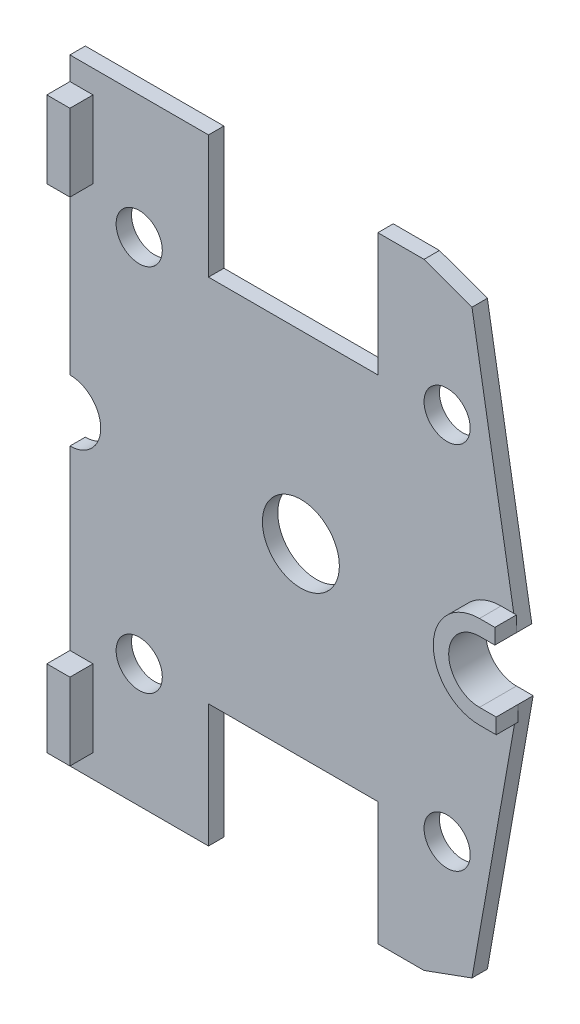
ISO-10303-21;
HEADER;
FILE_DESCRIPTION(('STEP AP214'),'2;1');
FILE_NAME('part.step','',(''),(''),'','','');
FILE_SCHEMA(('AUTOMOTIVE_DESIGN { 1 0 10303 214 1 1 1 1 }'));
ENDSEC;
DATA;
#1=APPLICATION_CONTEXT('core data for automotive mechanical design processes');
#2=APPLICATION_PROTOCOL_DEFINITION('international standard','automotive_design',2000,#1);
#3=PRODUCT_CONTEXT('',#1,'mechanical');
#4=PRODUCT('Part','Part','',(#3));
#5=PRODUCT_RELATED_PRODUCT_CATEGORY('part','',(#4));
#6=PRODUCT_DEFINITION_FORMATION('','',#4);
#7=PRODUCT_DEFINITION_CONTEXT('part definition',#1,'design');
#8=PRODUCT_DEFINITION('design','',#6,#7);
#9=PRODUCT_DEFINITION_SHAPE('','',#8);
#10=(LENGTH_UNIT() NAMED_UNIT(*) SI_UNIT(.MILLI.,.METRE.));
#11=(NAMED_UNIT(*) PLANE_ANGLE_UNIT() SI_UNIT($,.RADIAN.));
#12=(NAMED_UNIT(*) SI_UNIT($,.STERADIAN.) SOLID_ANGLE_UNIT());
#13=UNCERTAINTY_MEASURE_WITH_UNIT(LENGTH_MEASURE(1.E-05),#10,'distance_accuracy_value','');
#14=(GEOMETRIC_REPRESENTATION_CONTEXT(3) GLOBAL_UNCERTAINTY_ASSIGNED_CONTEXT((#13)) GLOBAL_UNIT_ASSIGNED_CONTEXT((#10,
#11,#12)) REPRESENTATION_CONTEXT('',''));
#15=CARTESIAN_POINT('',(0.,0.,0.));
#16=DIRECTION('',(0.,0.,1.));
#17=DIRECTION('',(1.,0.,0.));
#18=AXIS2_PLACEMENT_3D('',#15,#16,#17);
#19=CARTESIAN_POINT('',(0.,20.,1.));
#20=DIRECTION('',(0.,0.,1.));
#21=DIRECTION('',(1.,0.,0.));
#22=AXIS2_PLACEMENT_3D('',#19,#20,#21);
#23=PLANE('',#22);
#24=DIRECTION('',(1.,0.,0.));
#25=VECTOR('',#24,1.);
#26=CARTESIAN_POINT('',(28.,23.,1.));
#27=LINE('',#26,#25);
#28=CARTESIAN_POINT('',(28.,23.,1.));
#29=VERTEX_POINT('',#28);
#30=CARTESIAN_POINT('',(28.8289001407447,23.,1.));
#31=VERTEX_POINT('',#30);
#32=EDGE_CURVE('E263',#29,#31,#27,.T.);
#33=ORIENTED_EDGE('',*,*,#32,.T.);
#34=DIRECTION('',(-0.168649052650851,0.985676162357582,0.));
#35=VECTOR('',#34,1.);
#36=CARTESIAN_POINT('',(29.0000000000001,22.,1.));
#37=LINE('',#36,#35);
#38=CARTESIAN_POINT('',(26.1141361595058,38.8665471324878,1.));
#39=VERTEX_POINT('',#38);
#40=EDGE_CURVE('E474',#31,#39,#37,.T.);
#41=ORIENTED_EDGE('',*,*,#40,.T.);
#42=DIRECTION('',(-0.939692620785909,0.342020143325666,0.));
#43=VECTOR('',#42,1.);
#44=CARTESIAN_POINT('',(23.,40.,1.));
#45=LINE('',#44,#43);
#46=CARTESIAN_POINT('',(23.,40.,1.));
#47=VERTEX_POINT('',#46);
#48=EDGE_CURVE('E476',#39,#47,#45,.T.);
#49=ORIENTED_EDGE('',*,*,#48,.T.);
#50=DIRECTION('',(-1.,0.,0.));
#51=VECTOR('',#50,1.);
#52=CARTESIAN_POINT('',(20.,40.,1.));
#53=LINE('',#52,#51);
#54=CARTESIAN_POINT('',(20.,40.,1.));
#55=VERTEX_POINT('',#54);
#56=EDGE_CURVE('E478',#47,#55,#53,.T.);
#57=ORIENTED_EDGE('',*,*,#56,.T.);
#58=DIRECTION('',(0.,-1.,0.));
#59=VECTOR('',#58,1.);
#60=CARTESIAN_POINT('',(20.,32.,1.));
#61=LINE('',#60,#59);
#62=CARTESIAN_POINT('',(20.,32.,1.));
#63=VERTEX_POINT('',#62);
#64=EDGE_CURVE('E480',#55,#63,#61,.T.);
#65=ORIENTED_EDGE('',*,*,#64,.T.);
#66=DIRECTION('',(-1.,0.,0.));
#67=VECTOR('',#66,1.);
#68=CARTESIAN_POINT('',(9.,32.,1.));
#69=LINE('',#68,#67);
#70=CARTESIAN_POINT('',(9.,32.,1.));
#71=VERTEX_POINT('',#70);
#72=EDGE_CURVE('E482',#63,#71,#69,.T.);
#73=ORIENTED_EDGE('',*,*,#72,.T.);
#74=DIRECTION('',(0.,1.,0.));
#75=VECTOR('',#74,1.);
#76=CARTESIAN_POINT('',(9.,32.,1.));
#77=LINE('',#76,#75);
#78=CARTESIAN_POINT('',(9.,40.,1.));
#79=VERTEX_POINT('',#78);
#80=EDGE_CURVE('E484',#71,#79,#77,.T.);
#81=ORIENTED_EDGE('',*,*,#80,.T.);
#82=DIRECTION('',(-1.,0.,0.));
#83=VECTOR('',#82,1.);
#84=CARTESIAN_POINT('',(0.,40.,1.));
#85=LINE('',#84,#83);
#86=CARTESIAN_POINT('',(0.,40.,1.));
#87=VERTEX_POINT('',#86);
#88=EDGE_CURVE('E486',#79,#87,#85,.T.);
#89=ORIENTED_EDGE('',*,*,#88,.T.);
#90=DIRECTION('',(0.,-1.,0.));
#91=VECTOR('',#90,1.);
#92=CARTESIAN_POINT('',(0.,40.,1.));
#93=LINE('',#92,#91);
#94=CARTESIAN_POINT('',(0.,38.5,1.));
#95=VERTEX_POINT('',#94);
#96=EDGE_CURVE('E497',#87,#95,#93,.T.);
#97=ORIENTED_EDGE('',*,*,#96,.T.);
#98=DIRECTION('',(-1.,0.,0.));
#99=VECTOR('',#98,1.);
#100=CARTESIAN_POINT('',(0.,38.5,1.));
#101=LINE('',#100,#99);
#102=CARTESIAN_POINT('',(1.49999999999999,38.5,1.));
#103=VERTEX_POINT('',#102);
#104=EDGE_CURVE('E354',#103,#95,#101,.T.);
#105=ORIENTED_EDGE('',*,*,#104,.F.);
#106=DIRECTION('',(0.,1.,0.));
#107=VECTOR('',#106,1.);
#108=CARTESIAN_POINT('',(1.49999999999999,38.5,1.));
#109=LINE('',#108,#107);
#110=CARTESIAN_POINT('',(1.49999999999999,33.5,1.));
#111=VERTEX_POINT('',#110);
#112=EDGE_CURVE('E351',#111,#103,#109,.T.);
#113=ORIENTED_EDGE('',*,*,#112,.F.);
#114=DIRECTION('',(1.,0.,0.));
#115=VECTOR('',#114,1.);
#116=CARTESIAN_POINT('',(0.,33.5,1.));
#117=LINE('',#116,#115);
#118=CARTESIAN_POINT('',(0.,33.5,1.));
#119=VERTEX_POINT('',#118);
#120=EDGE_CURVE('E350',#119,#111,#117,.T.);
#121=ORIENTED_EDGE('',*,*,#120,.F.);
#122=CARTESIAN_POINT('',(0.,22.,1.));
#123=VERTEX_POINT('',#122);
#124=EDGE_CURVE('E488',#119,#123,#93,.T.);
#125=ORIENTED_EDGE('',*,*,#124,.T.);
#126=CARTESIAN_POINT('',(0.,20.,1.));
#127=DIRECTION('',(0.,0.,-1.));
#128=DIRECTION('',(1.,0.,0.));
#129=AXIS2_PLACEMENT_3D('',#126,#127,#128);
#130=CIRCLE('',#129,2.);
#131=CARTESIAN_POINT('',(0.,18.,1.));
#132=VERTEX_POINT('',#131);
#133=EDGE_CURVE('E491',#123,#132,#130,.T.);
#134=ORIENTED_EDGE('',*,*,#133,.T.);
#135=DIRECTION('',(0.,-1.,0.));
#136=VECTOR('',#135,1.);
#137=CARTESIAN_POINT('',(0.,0.,1.));
#138=LINE('',#137,#136);
#139=CARTESIAN_POINT('',(0.,6.5,1.));
#140=VERTEX_POINT('',#139);
#141=EDGE_CURVE('E458',#132,#140,#138,.T.);
#142=ORIENTED_EDGE('',*,*,#141,.T.);
#143=DIRECTION('',(-1.,0.,0.));
#144=VECTOR('',#143,1.);
#145=CARTESIAN_POINT('',(0.,6.5,1.));
#146=LINE('',#145,#144);
#147=CARTESIAN_POINT('',(1.5,6.5,1.));
#148=VERTEX_POINT('',#147);
#149=EDGE_CURVE('E326',#148,#140,#146,.T.);
#150=ORIENTED_EDGE('',*,*,#149,.F.);
#151=DIRECTION('',(0.,1.,0.));
#152=VECTOR('',#151,1.);
#153=CARTESIAN_POINT('',(1.5,1.5,1.));
#154=LINE('',#153,#152);
#155=CARTESIAN_POINT('',(1.5,1.5,1.));
#156=VERTEX_POINT('',#155);
#157=EDGE_CURVE('E323',#156,#148,#154,.T.);
#158=ORIENTED_EDGE('',*,*,#157,.F.);
#159=DIRECTION('',(1.,0.,0.));
#160=VECTOR('',#159,1.);
#161=CARTESIAN_POINT('',(0.,1.5,1.));
#162=LINE('',#161,#160);
#163=CARTESIAN_POINT('',(0.,1.5,1.));
#164=VERTEX_POINT('',#163);
#165=EDGE_CURVE('E320',#164,#156,#162,.T.);
#166=ORIENTED_EDGE('',*,*,#165,.F.);
#167=CARTESIAN_POINT('',(0.,0.,1.));
#168=VERTEX_POINT('',#167);
#169=EDGE_CURVE('E457',#164,#168,#138,.T.);
#170=ORIENTED_EDGE('',*,*,#169,.T.);
#171=DIRECTION('',(1.,0.,0.));
#172=VECTOR('',#171,1.);
#173=CARTESIAN_POINT('',(0.,0.,1.));
#174=LINE('',#173,#172);
#175=CARTESIAN_POINT('',(9.,0.,1.));
#176=VERTEX_POINT('',#175);
#177=EDGE_CURVE('E460',#168,#176,#174,.T.);
#178=ORIENTED_EDGE('',*,*,#177,.T.);
#179=DIRECTION('',(0.,1.,0.));
#180=VECTOR('',#179,1.);
#181=CARTESIAN_POINT('',(9.,8.,1.));
#182=LINE('',#181,#180);
#183=CARTESIAN_POINT('',(9.,8.,1.));
#184=VERTEX_POINT('',#183);
#185=EDGE_CURVE('E462',#176,#184,#182,.T.);
#186=ORIENTED_EDGE('',*,*,#185,.T.);
#187=DIRECTION('',(1.,0.,0.));
#188=VECTOR('',#187,1.);
#189=CARTESIAN_POINT('',(9.,8.,1.));
#190=LINE('',#189,#188);
#191=CARTESIAN_POINT('',(20.,8.,1.));
#192=VERTEX_POINT('',#191);
#193=EDGE_CURVE('E464',#184,#192,#190,.T.);
#194=ORIENTED_EDGE('',*,*,#193,.T.);
#195=DIRECTION('',(0.,-1.,0.));
#196=VECTOR('',#195,1.);
#197=CARTESIAN_POINT('',(20.,8.,1.));
#198=LINE('',#197,#196);
#199=CARTESIAN_POINT('',(20.,0.,1.));
#200=VERTEX_POINT('',#199);
#201=EDGE_CURVE('E466',#192,#200,#198,.T.);
#202=ORIENTED_EDGE('',*,*,#201,.T.);
#203=DIRECTION('',(1.,0.,0.));
#204=VECTOR('',#203,1.);
#205=CARTESIAN_POINT('',(20.,0.,1.));
#206=LINE('',#205,#204);
#207=CARTESIAN_POINT('',(23.,0.,1.));
#208=VERTEX_POINT('',#207);
#209=EDGE_CURVE('E468',#200,#208,#206,.T.);
#210=ORIENTED_EDGE('',*,*,#209,.T.);
#211=DIRECTION('',(0.939692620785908,0.342020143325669,0.));
#212=VECTOR('',#211,1.);
#213=CARTESIAN_POINT('',(23.,0.,1.));
#214=LINE('',#213,#212);
#215=CARTESIAN_POINT('',(26.1141361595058,1.13345286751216,1.));
#216=VERTEX_POINT('',#215);
#217=EDGE_CURVE('E470',#208,#216,#214,.T.);
#218=ORIENTED_EDGE('',*,*,#217,.T.);
#219=DIRECTION('',(0.173648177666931,0.984807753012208,0.));
#220=VECTOR('',#219,1.);
#221=CARTESIAN_POINT('',(29.0881634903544,18.,1.));
#222=LINE('',#221,#220);
#223=CARTESIAN_POINT('',(28.9118365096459,17.,1.));
#224=VERTEX_POINT('',#223);
#225=EDGE_CURVE('E472',#216,#224,#222,.T.);
#226=ORIENTED_EDGE('',*,*,#225,.T.);
#227=DIRECTION('',(1.,0.,0.));
#228=VECTOR('',#227,1.);
#229=CARTESIAN_POINT('',(29.0881634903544,17.,1.));
#230=LINE('',#229,#228);
#231=CARTESIAN_POINT('',(28.,17.,1.));
#232=VERTEX_POINT('',#231);
#233=EDGE_CURVE('E51',#224,#232,#230,.F.);
#234=ORIENTED_EDGE('',*,*,#233,.T.);
#235=CARTESIAN_POINT('',(28.,20.,1.));
#236=DIRECTION('',(0.,0.,1.));
#237=DIRECTION('',(1.,0.,0.));
#238=AXIS2_PLACEMENT_3D('',#235,#236,#237);
#239=CIRCLE('',#238,3.);
#240=EDGE_CURVE('E46',#232,#29,#239,.F.);
#241=ORIENTED_EDGE('',*,*,#240,.T.);
#242=EDGE_LOOP('',(#33,#41,#49,#57,#65,#73,#81,#89,#97,#105,#113,#121,#125,#134,#142,#150,#158,
#166,#170,#178,#186,#194,#202,#210,#218,#226,#234,#241));
#243=FACE_BOUND('',#242,.T.);
#244=CARTESIAN_POINT('',(15.,20.,1.));
#245=DIRECTION('',(0.,0.,1.));
#246=DIRECTION('',(1.,0.,0.));
#247=AXIS2_PLACEMENT_3D('',#244,#245,#246);
#248=CIRCLE('',#247,2.5);
#249=CARTESIAN_POINT('',(17.5,20.,1.));
#250=VERTEX_POINT('',#249);
#251=EDGE_CURVE('E413',#250,#250,#248,.T.);
#252=ORIENTED_EDGE('',*,*,#251,.F.);
#253=EDGE_LOOP('',(#252));
#254=FACE_BOUND('',#253,.T.);
#255=CARTESIAN_POINT('',(4.5,8.,1.));
#256=DIRECTION('',(0.,0.,1.));
#257=DIRECTION('',(1.,0.,0.));
#258=AXIS2_PLACEMENT_3D('',#255,#256,#257);
#259=CIRCLE('',#258,1.5);
#260=CARTESIAN_POINT('',(6.,8.,1.));
#261=VERTEX_POINT('',#260);
#262=EDGE_CURVE('E404',#261,#261,#259,.T.);
#263=ORIENTED_EDGE('',*,*,#262,.F.);
#264=EDGE_LOOP('',(#263));
#265=FACE_BOUND('',#264,.T.);
#266=CARTESIAN_POINT('',(24.5,8.,1.));
#267=DIRECTION('',(0.,0.,1.));
#268=DIRECTION('',(1.,0.,0.));
#269=AXIS2_PLACEMENT_3D('',#266,#267,#268);
#270=CIRCLE('',#269,1.5);
#271=CARTESIAN_POINT('',(26.,8.,1.));
#272=VERTEX_POINT('',#271);
#273=EDGE_CURVE('E398',#272,#272,#270,.T.);
#274=ORIENTED_EDGE('',*,*,#273,.F.);
#275=EDGE_LOOP('',(#274));
#276=FACE_BOUND('',#275,.T.);
#277=CARTESIAN_POINT('',(4.49999999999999,32.,1.));
#278=DIRECTION('',(0.,0.,1.));
#279=DIRECTION('',(1.,0.,0.));
#280=AXIS2_PLACEMENT_3D('',#277,#278,#279);
#281=CIRCLE('',#280,1.5);
#282=CARTESIAN_POINT('',(5.99999999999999,32.,1.));
#283=VERTEX_POINT('',#282);
#284=EDGE_CURVE('E392',#283,#283,#281,.T.);
#285=ORIENTED_EDGE('',*,*,#284,.F.);
#286=EDGE_LOOP('',(#285));
#287=FACE_BOUND('',#286,.T.);
#288=CARTESIAN_POINT('',(24.5,32.,1.));
#289=DIRECTION('',(0.,0.,1.));
#290=DIRECTION('',(1.,0.,0.));
#291=AXIS2_PLACEMENT_3D('',#288,#289,#290);
#292=CIRCLE('',#291,1.5);
#293=CARTESIAN_POINT('',(26.,32.,1.));
#294=VERTEX_POINT('',#293);
#295=EDGE_CURVE('E386',#294,#294,#292,.T.);
#296=ORIENTED_EDGE('',*,*,#295,.F.);
#297=EDGE_LOOP('',(#296));
#298=FACE_BOUND('',#297,.T.);
#299=ADVANCED_FACE('F29',(#243,#254,#265,#276,#287,#298),#23,.T.);
#300=CARTESIAN_POINT('',(0.,20.,0.));
#301=DIRECTION('',(0.,0.,1.));
#302=DIRECTION('',(1.,0.,0.));
#303=AXIS2_PLACEMENT_3D('',#300,#301,#302);
#304=PLANE('',#303);
#305=CARTESIAN_POINT('',(24.5,32.,0.));
#306=DIRECTION('',(0.,0.,1.));
#307=DIRECTION('',(1.,0.,0.));
#308=AXIS2_PLACEMENT_3D('',#305,#306,#307);
#309=CIRCLE('',#308,1.5);
#310=CARTESIAN_POINT('',(26.,32.,0.));
#311=VERTEX_POINT('',#310);
#312=EDGE_CURVE('E389',#311,#311,#309,.T.);
#313=ORIENTED_EDGE('',*,*,#312,.T.);
#314=EDGE_LOOP('',(#313));
#315=FACE_BOUND('',#314,.T.);
#316=CARTESIAN_POINT('',(4.49999999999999,32.,0.));
#317=DIRECTION('',(0.,0.,1.));
#318=DIRECTION('',(1.,0.,0.));
#319=AXIS2_PLACEMENT_3D('',#316,#317,#318);
#320=CIRCLE('',#319,1.5);
#321=CARTESIAN_POINT('',(5.99999999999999,32.,0.));
#322=VERTEX_POINT('',#321);
#323=EDGE_CURVE('E395',#322,#322,#320,.T.);
#324=ORIENTED_EDGE('',*,*,#323,.T.);
#325=EDGE_LOOP('',(#324));
#326=FACE_BOUND('',#325,.T.);
#327=CARTESIAN_POINT('',(24.5,8.,0.));
#328=DIRECTION('',(0.,0.,1.));
#329=DIRECTION('',(1.,0.,0.));
#330=AXIS2_PLACEMENT_3D('',#327,#328,#329);
#331=CIRCLE('',#330,1.5);
#332=CARTESIAN_POINT('',(26.,8.,0.));
#333=VERTEX_POINT('',#332);
#334=EDGE_CURVE('E401',#333,#333,#331,.T.);
#335=ORIENTED_EDGE('',*,*,#334,.T.);
#336=EDGE_LOOP('',(#335));
#337=FACE_BOUND('',#336,.T.);
#338=CARTESIAN_POINT('',(4.5,8.,0.));
#339=DIRECTION('',(0.,0.,1.));
#340=DIRECTION('',(1.,0.,0.));
#341=AXIS2_PLACEMENT_3D('',#338,#339,#340);
#342=CIRCLE('',#341,1.5);
#343=CARTESIAN_POINT('',(6.,8.,0.));
#344=VERTEX_POINT('',#343);
#345=EDGE_CURVE('E407',#344,#344,#342,.T.);
#346=ORIENTED_EDGE('',*,*,#345,.T.);
#347=EDGE_LOOP('',(#346));
#348=FACE_BOUND('',#347,.T.);
#349=DIRECTION('',(0.,-1.,0.));
#350=VECTOR('',#349,1.);
#351=CARTESIAN_POINT('',(0.,0.,0.));
#352=LINE('',#351,#350);
#353=CARTESIAN_POINT('',(0.,18.,0.));
#354=VERTEX_POINT('',#353);
#355=CARTESIAN_POINT('',(0.,0.,0.));
#356=VERTEX_POINT('',#355);
#357=EDGE_CURVE('E416',#354,#356,#352,.T.);
#358=ORIENTED_EDGE('',*,*,#357,.F.);
#359=CARTESIAN_POINT('',(0.,20.,0.));
#360=DIRECTION('',(0.,0.,-1.));
#361=DIRECTION('',(1.,0.,0.));
#362=AXIS2_PLACEMENT_3D('',#359,#360,#361);
#363=CIRCLE('',#362,2.);
#364=CARTESIAN_POINT('',(0.,22.,0.));
#365=VERTEX_POINT('',#364);
#366=EDGE_CURVE('E455',#365,#354,#363,.T.);
#367=ORIENTED_EDGE('',*,*,#366,.F.);
#368=DIRECTION('',(0.,-1.,0.));
#369=VECTOR('',#368,1.);
#370=CARTESIAN_POINT('',(0.,40.,0.));
#371=LINE('',#370,#369);
#372=CARTESIAN_POINT('',(0.,40.,0.));
#373=VERTEX_POINT('',#372);
#374=EDGE_CURVE('E453',#373,#365,#371,.T.);
#375=ORIENTED_EDGE('',*,*,#374,.F.);
#376=DIRECTION('',(-1.,0.,0.));
#377=VECTOR('',#376,1.);
#378=CARTESIAN_POINT('',(0.,40.,0.));
#379=LINE('',#378,#377);
#380=CARTESIAN_POINT('',(9.,40.,0.));
#381=VERTEX_POINT('',#380);
#382=EDGE_CURVE('E451',#381,#373,#379,.T.);
#383=ORIENTED_EDGE('',*,*,#382,.F.);
#384=DIRECTION('',(0.,1.,0.));
#385=VECTOR('',#384,1.);
#386=CARTESIAN_POINT('',(9.,32.,0.));
#387=LINE('',#386,#385);
#388=CARTESIAN_POINT('',(9.,32.,0.));
#389=VERTEX_POINT('',#388);
#390=EDGE_CURVE('E449',#389,#381,#387,.T.);
#391=ORIENTED_EDGE('',*,*,#390,.F.);
#392=DIRECTION('',(-1.,0.,0.));
#393=VECTOR('',#392,1.);
#394=CARTESIAN_POINT('',(9.,32.,0.));
#395=LINE('',#394,#393);
#396=CARTESIAN_POINT('',(20.,32.,0.));
#397=VERTEX_POINT('',#396);
#398=EDGE_CURVE('E447',#397,#389,#395,.T.);
#399=ORIENTED_EDGE('',*,*,#398,.F.);
#400=DIRECTION('',(0.,-1.,0.));
#401=VECTOR('',#400,1.);
#402=CARTESIAN_POINT('',(20.,32.,0.));
#403=LINE('',#402,#401);
#404=CARTESIAN_POINT('',(20.,40.,0.));
#405=VERTEX_POINT('',#404);
#406=EDGE_CURVE('E445',#405,#397,#403,.T.);
#407=ORIENTED_EDGE('',*,*,#406,.F.);
#408=DIRECTION('',(-1.,0.,0.));
#409=VECTOR('',#408,1.);
#410=CARTESIAN_POINT('',(20.,40.,0.));
#411=LINE('',#410,#409);
#412=CARTESIAN_POINT('',(23.,40.,0.));
#413=VERTEX_POINT('',#412);
#414=EDGE_CURVE('E443',#413,#405,#411,.T.);
#415=ORIENTED_EDGE('',*,*,#414,.F.);
#416=DIRECTION('',(-0.939692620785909,0.342020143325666,0.));
#417=VECTOR('',#416,1.);
#418=CARTESIAN_POINT('',(23.,40.,0.));
#419=LINE('',#418,#417);
#420=CARTESIAN_POINT('',(26.1141361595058,38.8665471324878,0.));
#421=VERTEX_POINT('',#420);
#422=EDGE_CURVE('E441',#421,#413,#419,.T.);
#423=ORIENTED_EDGE('',*,*,#422,.F.);
#424=DIRECTION('',(-0.168649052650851,0.985676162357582,0.));
#425=VECTOR('',#424,1.);
#426=CARTESIAN_POINT('',(29.0000000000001,22.,0.));
#427=LINE('',#426,#425);
#428=CARTESIAN_POINT('',(29.0000000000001,22.,0.));
#429=VERTEX_POINT('',#428);
#430=EDGE_CURVE('E439',#429,#421,#427,.T.);
#431=ORIENTED_EDGE('',*,*,#430,.F.);
#432=DIRECTION('',(1.,0.,0.));
#433=VECTOR('',#432,1.);
#434=CARTESIAN_POINT('',(28.,22.,0.));
#435=LINE('',#434,#433);
#436=CARTESIAN_POINT('',(28.,22.,0.));
#437=VERTEX_POINT('',#436);
#438=EDGE_CURVE('E437',#437,#429,#435,.T.);
#439=ORIENTED_EDGE('',*,*,#438,.F.);
#440=CARTESIAN_POINT('',(28.,20.,0.));
#441=DIRECTION('',(0.,0.,-1.));
#442=DIRECTION('',(1.,0.,0.));
#443=AXIS2_PLACEMENT_3D('',#440,#441,#442);
#444=CIRCLE('',#443,2.);
#445=CARTESIAN_POINT('',(28.,18.,0.));
#446=VERTEX_POINT('',#445);
#447=EDGE_CURVE('E435',#446,#437,#444,.T.);
#448=ORIENTED_EDGE('',*,*,#447,.F.);
#449=DIRECTION('',(-1.,0.,0.));
#450=VECTOR('',#449,1.);
#451=CARTESIAN_POINT('',(28.,18.,0.));
#452=LINE('',#451,#450);
#453=CARTESIAN_POINT('',(29.0881634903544,18.,0.));
#454=VERTEX_POINT('',#453);
#455=EDGE_CURVE('E433',#454,#446,#452,.T.);
#456=ORIENTED_EDGE('',*,*,#455,.F.);
#457=DIRECTION('',(0.173648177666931,0.984807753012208,0.));
#458=VECTOR('',#457,1.);
#459=CARTESIAN_POINT('',(29.0881634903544,18.,0.));
#460=LINE('',#459,#458);
#461=CARTESIAN_POINT('',(26.1141361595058,1.13345286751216,0.));
#462=VERTEX_POINT('',#461);
#463=EDGE_CURVE('E431',#462,#454,#460,.T.);
#464=ORIENTED_EDGE('',*,*,#463,.F.);
#465=DIRECTION('',(0.939692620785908,0.342020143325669,0.));
#466=VECTOR('',#465,1.);
#467=CARTESIAN_POINT('',(23.,0.,0.));
#468=LINE('',#467,#466);
#469=CARTESIAN_POINT('',(23.,0.,0.));
#470=VERTEX_POINT('',#469);
#471=EDGE_CURVE('E429',#470,#462,#468,.T.);
#472=ORIENTED_EDGE('',*,*,#471,.F.);
#473=DIRECTION('',(1.,0.,0.));
#474=VECTOR('',#473,1.);
#475=CARTESIAN_POINT('',(20.,0.,0.));
#476=LINE('',#475,#474);
#477=CARTESIAN_POINT('',(20.,0.,0.));
#478=VERTEX_POINT('',#477);
#479=EDGE_CURVE('E427',#478,#470,#476,.T.);
#480=ORIENTED_EDGE('',*,*,#479,.F.);
#481=DIRECTION('',(0.,-1.,0.));
#482=VECTOR('',#481,1.);
#483=CARTESIAN_POINT('',(20.,8.,0.));
#484=LINE('',#483,#482);
#485=CARTESIAN_POINT('',(20.,8.,0.));
#486=VERTEX_POINT('',#485);
#487=EDGE_CURVE('E425',#486,#478,#484,.T.);
#488=ORIENTED_EDGE('',*,*,#487,.F.);
#489=DIRECTION('',(1.,0.,0.));
#490=VECTOR('',#489,1.);
#491=CARTESIAN_POINT('',(9.,8.,0.));
#492=LINE('',#491,#490);
#493=CARTESIAN_POINT('',(9.,8.,0.));
#494=VERTEX_POINT('',#493);
#495=EDGE_CURVE('E423',#494,#486,#492,.T.);
#496=ORIENTED_EDGE('',*,*,#495,.F.);
#497=DIRECTION('',(0.,1.,0.));
#498=VECTOR('',#497,1.);
#499=CARTESIAN_POINT('',(9.,8.,0.));
#500=LINE('',#499,#498);
#501=CARTESIAN_POINT('',(9.,0.,0.));
#502=VERTEX_POINT('',#501);
#503=EDGE_CURVE('E421',#502,#494,#500,.T.);
#504=ORIENTED_EDGE('',*,*,#503,.F.);
#505=DIRECTION('',(1.,0.,0.));
#506=VECTOR('',#505,1.);
#507=CARTESIAN_POINT('',(0.,0.,0.));
#508=LINE('',#507,#506);
#509=EDGE_CURVE('E419',#356,#502,#508,.T.);
#510=ORIENTED_EDGE('',*,*,#509,.F.);
#511=EDGE_LOOP('',(#358,#367,#375,#383,#391,#399,#407,#415,#423,#431,#439,#448,#456,#464,#472,
#480,#488,#496,#504,#510));
#512=FACE_BOUND('',#511,.T.);
#513=CARTESIAN_POINT('',(15.,20.,0.));
#514=DIRECTION('',(0.,0.,1.));
#515=DIRECTION('',(1.,0.,0.));
#516=AXIS2_PLACEMENT_3D('',#513,#514,#515);
#517=CIRCLE('',#516,2.5);
#518=CARTESIAN_POINT('',(17.5,20.,0.));
#519=VERTEX_POINT('',#518);
#520=EDGE_CURVE('E410',#519,#519,#517,.T.);
#521=ORIENTED_EDGE('',*,*,#520,.T.);
#522=EDGE_LOOP('',(#521));
#523=FACE_BOUND('',#522,.T.);
#524=ADVANCED_FACE('F585',(#315,#326,#337,#348,#512,#523),#304,.F.);
#525=CARTESIAN_POINT('',(0.,0.,1.));
#526=DIRECTION('',(1.,0.,0.));
#527=DIRECTION('',(0.,0.,-1.));
#528=AXIS2_PLACEMENT_3D('',#525,#526,#527);
#529=PLANE('',#528);
#530=ORIENTED_EDGE('',*,*,#357,.T.);
#531=DIRECTION('',(0.,0.,-1.));
#532=VECTOR('',#531,1.);
#533=CARTESIAN_POINT('',(0.,0.,1.));
#534=LINE('',#533,#532);
#535=EDGE_CURVE('E11',#168,#356,#534,.T.);
#536=ORIENTED_EDGE('',*,*,#535,.F.);
#537=ORIENTED_EDGE('',*,*,#169,.F.);
#538=DIRECTION('',(0.,0.,-1.));
#539=VECTOR('',#538,1.);
#540=CARTESIAN_POINT('',(0.,1.5,2.5));
#541=LINE('',#540,#539);
#542=CARTESIAN_POINT('',(0.,1.5,2.5));
#543=VERTEX_POINT('',#542);
#544=EDGE_CURVE('E338',#543,#164,#541,.T.);
#545=ORIENTED_EDGE('',*,*,#544,.F.);
#546=DIRECTION('',(0.,-1.,0.));
#547=VECTOR('',#546,1.);
#548=CARTESIAN_POINT('',(0.,1.5,2.5));
#549=LINE('',#548,#547);
#550=CARTESIAN_POINT('',(0.,6.5,2.5));
#551=VERTEX_POINT('',#550);
#552=EDGE_CURVE('E336',#551,#543,#549,.T.);
#553=ORIENTED_EDGE('',*,*,#552,.F.);
#554=DIRECTION('',(0.,0.,-1.));
#555=VECTOR('',#554,1.);
#556=CARTESIAN_POINT('',(0.,6.5,2.5));
#557=LINE('',#556,#555);
#558=EDGE_CURVE('E341',#551,#140,#557,.T.);
#559=ORIENTED_EDGE('',*,*,#558,.T.);
#560=ORIENTED_EDGE('',*,*,#141,.F.);
#561=DIRECTION('',(0.,0.,-1.));
#562=VECTOR('',#561,1.);
#563=CARTESIAN_POINT('',(0.,18.,1.));
#564=LINE('',#563,#562);
#565=EDGE_CURVE('E551',#132,#354,#564,.T.);
#566=ORIENTED_EDGE('',*,*,#565,.T.);
#567=EDGE_LOOP('',(#530,#536,#537,#545,#553,#559,#560,#566));
#568=FACE_BOUND('',#567,.T.);
#569=ADVANCED_FACE('F31',(#568),#529,.F.);
#570=CARTESIAN_POINT('',(0.,0.,1.));
#571=DIRECTION('',(0.,1.,0.));
#572=DIRECTION('',(0.,0.,1.));
#573=AXIS2_PLACEMENT_3D('',#570,#571,#572);
#574=PLANE('',#573);
#575=ORIENTED_EDGE('',*,*,#509,.T.);
#576=DIRECTION('',(0.,0.,-1.));
#577=VECTOR('',#576,1.);
#578=CARTESIAN_POINT('',(9.,0.,1.));
#579=LINE('',#578,#577);
#580=EDGE_CURVE('E38',#176,#502,#579,.T.);
#581=ORIENTED_EDGE('',*,*,#580,.F.);
#582=ORIENTED_EDGE('',*,*,#177,.F.);
#583=ORIENTED_EDGE('',*,*,#535,.T.);
#584=EDGE_LOOP('',(#575,#581,#582,#583));
#585=FACE_BOUND('',#584,.T.);
#586=ADVANCED_FACE('F582',(#585),#574,.F.);
#587=CARTESIAN_POINT('',(9.,8.,1.));
#588=DIRECTION('',(-1.,0.,0.));
#589=DIRECTION('',(0.,-1.,0.));
#590=AXIS2_PLACEMENT_3D('',#587,#588,#589);
#591=PLANE('',#590);
#592=ORIENTED_EDGE('',*,*,#503,.T.);
#593=DIRECTION('',(0.,0.,-1.));
#594=VECTOR('',#593,1.);
#595=CARTESIAN_POINT('',(9.,8.,1.));
#596=LINE('',#595,#594);
#597=EDGE_CURVE('E501',#184,#494,#596,.T.);
#598=ORIENTED_EDGE('',*,*,#597,.F.);
#599=ORIENTED_EDGE('',*,*,#185,.F.);
#600=ORIENTED_EDGE('',*,*,#580,.T.);
#601=EDGE_LOOP('',(#592,#598,#599,#600));
#602=FACE_BOUND('',#601,.T.);
#603=ADVANCED_FACE('F591',(#602),#591,.F.);
#604=CARTESIAN_POINT('',(9.,8.,1.));
#605=DIRECTION('',(0.,1.,0.));
#606=DIRECTION('',(0.,0.,1.));
#607=AXIS2_PLACEMENT_3D('',#604,#605,#606);
#608=PLANE('',#607);
#609=ORIENTED_EDGE('',*,*,#495,.T.);
#610=DIRECTION('',(0.,0.,-1.));
#611=VECTOR('',#610,1.);
#612=CARTESIAN_POINT('',(20.,8.,1.));
#613=LINE('',#612,#611);
#614=EDGE_CURVE('E504',#192,#486,#613,.T.);
#615=ORIENTED_EDGE('',*,*,#614,.F.);
#616=ORIENTED_EDGE('',*,*,#193,.F.);
#617=ORIENTED_EDGE('',*,*,#597,.T.);
#618=EDGE_LOOP('',(#609,#615,#616,#617));
#619=FACE_BOUND('',#618,.T.);
#620=ADVANCED_FACE('F598',(#619),#608,.F.);
#621=CARTESIAN_POINT('',(20.,8.,1.));
#622=DIRECTION('',(1.,0.,0.));
#623=DIRECTION('',(0.,0.,-1.));
#624=AXIS2_PLACEMENT_3D('',#621,#622,#623);
#625=PLANE('',#624);
#626=ORIENTED_EDGE('',*,*,#487,.T.);
#627=DIRECTION('',(0.,0.,-1.));
#628=VECTOR('',#627,1.);
#629=CARTESIAN_POINT('',(20.,0.,1.));
#630=LINE('',#629,#628);
#631=EDGE_CURVE('E507',#200,#478,#630,.T.);
#632=ORIENTED_EDGE('',*,*,#631,.F.);
#633=ORIENTED_EDGE('',*,*,#201,.F.);
#634=ORIENTED_EDGE('',*,*,#614,.T.);
#635=EDGE_LOOP('',(#626,#632,#633,#634));
#636=FACE_BOUND('',#635,.T.);
#637=ADVANCED_FACE('F601',(#636),#625,.F.);
#638=CARTESIAN_POINT('',(20.,0.,1.));
#639=DIRECTION('',(0.,1.,0.));
#640=DIRECTION('',(-1.,0.,0.));
#641=AXIS2_PLACEMENT_3D('',#638,#639,#640);
#642=PLANE('',#641);
#643=ORIENTED_EDGE('',*,*,#479,.T.);
#644=DIRECTION('',(0.,0.,-1.));
#645=VECTOR('',#644,1.);
#646=CARTESIAN_POINT('',(23.,0.,1.));
#647=LINE('',#646,#645);
#648=EDGE_CURVE('E510',#208,#470,#647,.T.);
#649=ORIENTED_EDGE('',*,*,#648,.F.);
#650=ORIENTED_EDGE('',*,*,#209,.F.);
#651=ORIENTED_EDGE('',*,*,#631,.T.);
#652=EDGE_LOOP('',(#643,#649,#650,#651));
#653=FACE_BOUND('',#652,.T.);
#654=ADVANCED_FACE('F606',(#653),#642,.F.);
#655=CARTESIAN_POINT('',(23.,0.,1.));
#656=DIRECTION('',(-0.342020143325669,0.939692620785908,0.));
#657=DIRECTION('',(-0.939692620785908,-0.342020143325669,0.));
#658=AXIS2_PLACEMENT_3D('',#655,#656,#657);
#659=PLANE('',#658);
#660=ORIENTED_EDGE('',*,*,#471,.T.);
#661=DIRECTION('',(0.,0.,-1.));
#662=VECTOR('',#661,1.);
#663=CARTESIAN_POINT('',(26.1141361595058,1.13345286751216,1.));
#664=LINE('',#663,#662);
#665=EDGE_CURVE('E513',#216,#462,#664,.T.);
#666=ORIENTED_EDGE('',*,*,#665,.F.);
#667=ORIENTED_EDGE('',*,*,#217,.F.);
#668=ORIENTED_EDGE('',*,*,#648,.T.);
#669=EDGE_LOOP('',(#660,#666,#667,#668));
#670=FACE_BOUND('',#669,.T.);
#671=ADVANCED_FACE('F611',(#670),#659,.F.);
#672=CARTESIAN_POINT('',(29.0881634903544,18.,1.));
#673=DIRECTION('',(-0.984807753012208,0.173648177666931,0.));
#674=DIRECTION('',(-0.173648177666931,-0.984807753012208,0.));
#675=AXIS2_PLACEMENT_3D('',#672,#673,#674);
#676=PLANE('',#675);
#677=ORIENTED_EDGE('',*,*,#463,.T.);
#678=DIRECTION('',(0.,0.,-1.));
#679=VECTOR('',#678,1.);
#680=CARTESIAN_POINT('',(29.0881634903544,18.,1.));
#681=LINE('',#680,#679);
#682=CARTESIAN_POINT('',(29.0881634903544,18.,1.));
#683=VERTEX_POINT('',#682);
#684=EDGE_CURVE('E516',#683,#454,#681,.T.);
#685=ORIENTED_EDGE('',*,*,#684,.F.);
#686=DIRECTION('',(0.173648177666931,0.984807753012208,0.));
#687=VECTOR('',#686,1.);
#688=CARTESIAN_POINT('',(29.0881634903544,18.,1.));
#689=LINE('',#688,#687);
#690=EDGE_CURVE('E317',#224,#683,#689,.T.);
#691=ORIENTED_EDGE('',*,*,#690,.F.);
#692=ORIENTED_EDGE('',*,*,#225,.F.);
#693=ORIENTED_EDGE('',*,*,#665,.T.);
#694=EDGE_LOOP('',(#677,#685,#691,#692,#693));
#695=FACE_BOUND('',#694,.T.);
#696=ADVANCED_FACE('F615',(#695),#676,.F.);
#697=CARTESIAN_POINT('',(28.,18.,1.));
#698=DIRECTION('',(0.,-1.,0.));
#699=DIRECTION('',(0.,0.,-1.));
#700=AXIS2_PLACEMENT_3D('',#697,#698,#699);
#701=PLANE('',#700);
#702=ORIENTED_EDGE('',*,*,#455,.T.);
#703=DIRECTION('',(0.,0.,-1.));
#704=VECTOR('',#703,1.);
#705=CARTESIAN_POINT('',(28.,18.,1.));
#706=LINE('',#705,#704);
#707=CARTESIAN_POINT('',(28.,18.,2.4));
#708=VERTEX_POINT('',#707);
#709=EDGE_CURVE('E519',#708,#446,#706,.T.);
#710=ORIENTED_EDGE('',*,*,#709,.F.);
#711=DIRECTION('',(-1.,0.,0.));
#712=VECTOR('',#711,1.);
#713=CARTESIAN_POINT('',(29.0881634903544,18.,2.4));
#714=LINE('',#713,#712);
#715=CARTESIAN_POINT('',(29.0881634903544,18.,2.4));
#716=VERTEX_POINT('',#715);
#717=EDGE_CURVE('E302',#716,#708,#714,.T.);
#718=ORIENTED_EDGE('',*,*,#717,.F.);
#719=DIRECTION('',(0.,0.,-1.));
#720=VECTOR('',#719,1.);
#721=CARTESIAN_POINT('',(29.0881634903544,18.,2.4));
#722=LINE('',#721,#720);
#723=EDGE_CURVE('E308',#716,#683,#722,.T.);
#724=ORIENTED_EDGE('',*,*,#723,.T.);
#725=ORIENTED_EDGE('',*,*,#684,.T.);
#726=EDGE_LOOP('',(#702,#710,#718,#724,#725));
#727=FACE_BOUND('',#726,.T.);
#728=ADVANCED_FACE('F622',(#727),#701,.F.);
#729=CARTESIAN_POINT('',(28.,20.,1.));
#730=DIRECTION('',(0.,0.,-1.));
#731=DIRECTION('',(-1.,0.,0.));
#732=AXIS2_PLACEMENT_3D('',#729,#730,#731);
#733=CYLINDRICAL_SURFACE('',#732,2.);
#734=ORIENTED_EDGE('',*,*,#447,.T.);
#735=DIRECTION('',(0.,0.,-1.));
#736=VECTOR('',#735,1.);
#737=CARTESIAN_POINT('',(28.,22.,1.));
#738=LINE('',#737,#736);
#739=CARTESIAN_POINT('',(28.,22.,2.4));
#740=VERTEX_POINT('',#739);
#741=EDGE_CURVE('E522',#740,#437,#738,.T.);
#742=ORIENTED_EDGE('',*,*,#741,.F.);
#743=CARTESIAN_POINT('',(28.,20.,2.4));
#744=DIRECTION('',(0.,0.,-1.));
#745=DIRECTION('',(1.,0.,0.));
#746=AXIS2_PLACEMENT_3D('',#743,#744,#745);
#747=CIRCLE('',#746,2.);
#748=EDGE_CURVE('E305',#708,#740,#747,.T.);
#749=ORIENTED_EDGE('',*,*,#748,.F.);
#750=ORIENTED_EDGE('',*,*,#709,.T.);
#751=EDGE_LOOP('',(#734,#742,#749,#750));
#752=FACE_BOUND('',#751,.T.);
#753=ADVANCED_FACE('F802',(#752),#733,.F.);
#754=CARTESIAN_POINT('',(28.,22.,1.));
#755=DIRECTION('',(0.,1.,0.));
#756=DIRECTION('',(0.,0.,1.));
#757=AXIS2_PLACEMENT_3D('',#754,#755,#756);
#758=PLANE('',#757);
#759=ORIENTED_EDGE('',*,*,#438,.T.);
#760=DIRECTION('',(0.,0.,-1.));
#761=VECTOR('',#760,1.);
#762=CARTESIAN_POINT('',(29.0000000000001,22.,1.));
#763=LINE('',#762,#761);
#764=CARTESIAN_POINT('',(29.0000000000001,22.,1.));
#765=VERTEX_POINT('',#764);
#766=EDGE_CURVE('E525',#765,#429,#763,.T.);
#767=ORIENTED_EDGE('',*,*,#766,.F.);
#768=DIRECTION('',(0.,0.,-1.));
#769=VECTOR('',#768,1.);
#770=CARTESIAN_POINT('',(29.0000000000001,22.,2.4));
#771=LINE('',#770,#769);
#772=CARTESIAN_POINT('',(29.0000000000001,22.,2.4));
#773=VERTEX_POINT('',#772);
#774=EDGE_CURVE('E273',#773,#765,#771,.T.);
#775=ORIENTED_EDGE('',*,*,#774,.F.);
#776=DIRECTION('',(1.,0.,0.));
#777=VECTOR('',#776,1.);
#778=CARTESIAN_POINT('',(28.,22.,2.4));
#779=LINE('',#778,#777);
#780=EDGE_CURVE('E288',#740,#773,#779,.T.);
#781=ORIENTED_EDGE('',*,*,#780,.F.);
#782=ORIENTED_EDGE('',*,*,#741,.T.);
#783=EDGE_LOOP('',(#759,#767,#775,#781,#782));
#784=FACE_BOUND('',#783,.T.);
#785=ADVANCED_FACE('F795',(#784),#758,.F.);
#786=CARTESIAN_POINT('',(29.0000000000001,22.,1.));
#787=DIRECTION('',(-0.985676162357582,-0.168649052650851,0.));
#788=DIRECTION('',(0.168649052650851,-0.985676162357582,0.));
#789=AXIS2_PLACEMENT_3D('',#786,#787,#788);
#790=PLANE('',#789);
#791=ORIENTED_EDGE('',*,*,#430,.T.);
#792=DIRECTION('',(0.,0.,-1.));
#793=VECTOR('',#792,1.);
#794=CARTESIAN_POINT('',(26.1141361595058,38.8665471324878,1.));
#795=LINE('',#794,#793);
#796=EDGE_CURVE('E528',#39,#421,#795,.T.);
#797=ORIENTED_EDGE('',*,*,#796,.F.);
#798=ORIENTED_EDGE('',*,*,#40,.F.);
#799=EDGE_CURVE('E260',#765,#31,#37,.T.);
#800=ORIENTED_EDGE('',*,*,#799,.F.);
#801=ORIENTED_EDGE('',*,*,#766,.T.);
#802=EDGE_LOOP('',(#791,#797,#798,#800,#801));
#803=FACE_BOUND('',#802,.T.);
#804=ADVANCED_FACE('F637',(#803),#790,.F.);
#805=CARTESIAN_POINT('',(23.,40.,1.));
#806=DIRECTION('',(-0.342020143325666,-0.939692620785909,0.));
#807=DIRECTION('',(0.939692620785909,-0.342020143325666,0.));
#808=AXIS2_PLACEMENT_3D('',#805,#806,#807);
#809=PLANE('',#808);
#810=ORIENTED_EDGE('',*,*,#422,.T.);
#811=DIRECTION('',(0.,0.,-1.));
#812=VECTOR('',#811,1.);
#813=CARTESIAN_POINT('',(23.,40.,1.));
#814=LINE('',#813,#812);
#815=EDGE_CURVE('E531',#47,#413,#814,.T.);
#816=ORIENTED_EDGE('',*,*,#815,.F.);
#817=ORIENTED_EDGE('',*,*,#48,.F.);
#818=ORIENTED_EDGE('',*,*,#796,.T.);
#819=EDGE_LOOP('',(#810,#816,#817,#818));
#820=FACE_BOUND('',#819,.T.);
#821=ADVANCED_FACE('F641',(#820),#809,.F.);
#822=CARTESIAN_POINT('',(20.,40.,1.));
#823=DIRECTION('',(0.,-1.,0.));
#824=DIRECTION('',(1.,0.,0.));
#825=AXIS2_PLACEMENT_3D('',#822,#823,#824);
#826=PLANE('',#825);
#827=ORIENTED_EDGE('',*,*,#414,.T.);
#828=DIRECTION('',(0.,0.,-1.));
#829=VECTOR('',#828,1.);
#830=CARTESIAN_POINT('',(20.,40.,1.));
#831=LINE('',#830,#829);
#832=EDGE_CURVE('E534',#55,#405,#831,.T.);
#833=ORIENTED_EDGE('',*,*,#832,.F.);
#834=ORIENTED_EDGE('',*,*,#56,.F.);
#835=ORIENTED_EDGE('',*,*,#815,.T.);
#836=EDGE_LOOP('',(#827,#833,#834,#835));
#837=FACE_BOUND('',#836,.T.);
#838=ADVANCED_FACE('F646',(#837),#826,.F.);
#839=CARTESIAN_POINT('',(20.,32.,1.));
#840=DIRECTION('',(1.,0.,0.));
#841=DIRECTION('',(0.,0.,-1.));
#842=AXIS2_PLACEMENT_3D('',#839,#840,#841);
#843=PLANE('',#842);
#844=ORIENTED_EDGE('',*,*,#406,.T.);
#845=DIRECTION('',(0.,0.,-1.));
#846=VECTOR('',#845,1.);
#847=CARTESIAN_POINT('',(20.,32.,1.));
#848=LINE('',#847,#846);
#849=EDGE_CURVE('E537',#63,#397,#848,.T.);
#850=ORIENTED_EDGE('',*,*,#849,.F.);
#851=ORIENTED_EDGE('',*,*,#64,.F.);
#852=ORIENTED_EDGE('',*,*,#832,.T.);
#853=EDGE_LOOP('',(#844,#850,#851,#852));
#854=FACE_BOUND('',#853,.T.);
#855=ADVANCED_FACE('F652',(#854),#843,.F.);
#856=CARTESIAN_POINT('',(9.,32.,1.));
#857=DIRECTION('',(0.,-1.,0.));
#858=DIRECTION('',(0.,0.,-1.));
#859=AXIS2_PLACEMENT_3D('',#856,#857,#858);
#860=PLANE('',#859);
#861=ORIENTED_EDGE('',*,*,#398,.T.);
#862=DIRECTION('',(0.,0.,-1.));
#863=VECTOR('',#862,1.);
#864=CARTESIAN_POINT('',(9.,32.,1.));
#865=LINE('',#864,#863);
#866=EDGE_CURVE('E540',#71,#389,#865,.T.);
#867=ORIENTED_EDGE('',*,*,#866,.F.);
#868=ORIENTED_EDGE('',*,*,#72,.F.);
#869=ORIENTED_EDGE('',*,*,#849,.T.);
#870=EDGE_LOOP('',(#861,#867,#868,#869));
#871=FACE_BOUND('',#870,.T.);
#872=ADVANCED_FACE('F656',(#871),#860,.F.);
#873=CARTESIAN_POINT('',(9.,32.,1.));
#874=DIRECTION('',(-1.,0.,0.));
#875=DIRECTION('',(0.,-1.,0.));
#876=AXIS2_PLACEMENT_3D('',#873,#874,#875);
#877=PLANE('',#876);
#878=ORIENTED_EDGE('',*,*,#390,.T.);
#879=DIRECTION('',(0.,0.,-1.));
#880=VECTOR('',#879,1.);
#881=CARTESIAN_POINT('',(9.,40.,1.));
#882=LINE('',#881,#880);
#883=EDGE_CURVE('E543',#79,#381,#882,.T.);
#884=ORIENTED_EDGE('',*,*,#883,.F.);
#885=ORIENTED_EDGE('',*,*,#80,.F.);
#886=ORIENTED_EDGE('',*,*,#866,.T.);
#887=EDGE_LOOP('',(#878,#884,#885,#886));
#888=FACE_BOUND('',#887,.T.);
#889=ADVANCED_FACE('F661',(#888),#877,.F.);
#890=CARTESIAN_POINT('',(0.,40.,1.));
#891=DIRECTION('',(0.,-1.,0.));
#892=DIRECTION('',(0.,0.,-1.));
#893=AXIS2_PLACEMENT_3D('',#890,#891,#892);
#894=PLANE('',#893);
#895=ORIENTED_EDGE('',*,*,#382,.T.);
#896=DIRECTION('',(0.,0.,-1.));
#897=VECTOR('',#896,1.);
#898=CARTESIAN_POINT('',(0.,40.,1.));
#899=LINE('',#898,#897);
#900=EDGE_CURVE('E546',#87,#373,#899,.T.);
#901=ORIENTED_EDGE('',*,*,#900,.F.);
#902=ORIENTED_EDGE('',*,*,#88,.F.);
#903=ORIENTED_EDGE('',*,*,#883,.T.);
#904=EDGE_LOOP('',(#895,#901,#902,#903));
#905=FACE_BOUND('',#904,.T.);
#906=ADVANCED_FACE('F665',(#905),#894,.F.);
#907=CARTESIAN_POINT('',(0.,40.,1.));
#908=DIRECTION('',(1.,0.,0.));
#909=DIRECTION('',(0.,1.,0.));
#910=AXIS2_PLACEMENT_3D('',#907,#908,#909);
#911=PLANE('',#910);
#912=ORIENTED_EDGE('',*,*,#374,.T.);
#913=DIRECTION('',(0.,0.,-1.));
#914=VECTOR('',#913,1.);
#915=CARTESIAN_POINT('',(0.,22.,1.));
#916=LINE('',#915,#914);
#917=EDGE_CURVE('E549',#123,#365,#916,.T.);
#918=ORIENTED_EDGE('',*,*,#917,.F.);
#919=ORIENTED_EDGE('',*,*,#124,.F.);
#920=DIRECTION('',(0.,0.,-1.));
#921=VECTOR('',#920,1.);
#922=CARTESIAN_POINT('',(0.,33.5,2.5));
#923=LINE('',#922,#921);
#924=CARTESIAN_POINT('',(0.,33.5,2.5));
#925=VERTEX_POINT('',#924);
#926=EDGE_CURVE('E385',#925,#119,#923,.T.);
#927=ORIENTED_EDGE('',*,*,#926,.F.);
#928=DIRECTION('',(0.,-1.,0.));
#929=VECTOR('',#928,1.);
#930=CARTESIAN_POINT('',(0.,38.5,2.5));
#931=LINE('',#930,#929);
#932=CARTESIAN_POINT('',(0.,38.5,2.5));
#933=VERTEX_POINT('',#932);
#934=EDGE_CURVE('E357',#933,#925,#931,.T.);
#935=ORIENTED_EDGE('',*,*,#934,.F.);
#936=DIRECTION('',(0.,0.,-1.));
#937=VECTOR('',#936,1.);
#938=CARTESIAN_POINT('',(0.,38.5,2.5));
#939=LINE('',#938,#937);
#940=EDGE_CURVE('E364',#933,#95,#939,.T.);
#941=ORIENTED_EDGE('',*,*,#940,.T.);
#942=ORIENTED_EDGE('',*,*,#96,.F.);
#943=ORIENTED_EDGE('',*,*,#900,.T.);
#944=EDGE_LOOP('',(#912,#918,#919,#927,#935,#941,#942,#943));
#945=FACE_BOUND('',#944,.T.);
#946=ADVANCED_FACE('F667',(#945),#911,.F.);
#947=CARTESIAN_POINT('',(0.,20.,1.));
#948=DIRECTION('',(0.,0.,-1.));
#949=DIRECTION('',(-1.,0.,0.));
#950=AXIS2_PLACEMENT_3D('',#947,#948,#949);
#951=CYLINDRICAL_SURFACE('',#950,2.);
#952=ORIENTED_EDGE('',*,*,#366,.T.);
#953=ORIENTED_EDGE('',*,*,#565,.F.);
#954=ORIENTED_EDGE('',*,*,#133,.F.);
#955=ORIENTED_EDGE('',*,*,#917,.T.);
#956=EDGE_LOOP('',(#952,#953,#954,#955));
#957=FACE_BOUND('',#956,.T.);
#958=ADVANCED_FACE('F562',(#957),#951,.F.);
#959=CARTESIAN_POINT('',(15.,20.,1.));
#960=DIRECTION('',(0.,0.,-1.));
#961=DIRECTION('',(-1.,0.,0.));
#962=AXIS2_PLACEMENT_3D('',#959,#960,#961);
#963=CYLINDRICAL_SURFACE('',#962,2.5);
#964=ORIENTED_EDGE('',*,*,#251,.T.);
#965=EDGE_LOOP('',(#964));
#966=FACE_BOUND('',#965,.T.);
#967=ORIENTED_EDGE('',*,*,#520,.F.);
#968=EDGE_LOOP('',(#967));
#969=FACE_BOUND('',#968,.T.);
#970=ADVANCED_FACE('F674',(#966,#969),#963,.F.);
#971=CARTESIAN_POINT('',(4.5,8.,0.));
#972=DIRECTION('',(0.,0.,1.));
#973=DIRECTION('',(1.,0.,0.));
#974=AXIS2_PLACEMENT_3D('',#971,#972,#973);
#975=CYLINDRICAL_SURFACE('',#974,1.5);
#976=ORIENTED_EDGE('',*,*,#345,.F.);
#977=EDGE_LOOP('',(#976));
#978=FACE_BOUND('',#977,.T.);
#979=ORIENTED_EDGE('',*,*,#262,.T.);
#980=EDGE_LOOP('',(#979));
#981=FACE_BOUND('',#980,.T.);
#982=ADVANCED_FACE('F687',(#978,#981),#975,.F.);
#983=CARTESIAN_POINT('',(24.5,8.,0.));
#984=DIRECTION('',(0.,0.,1.));
#985=DIRECTION('',(1.,0.,0.));
#986=AXIS2_PLACEMENT_3D('',#983,#984,#985);
#987=CYLINDRICAL_SURFACE('',#986,1.5);
#988=ORIENTED_EDGE('',*,*,#334,.F.);
#989=EDGE_LOOP('',(#988));
#990=FACE_BOUND('',#989,.T.);
#991=ORIENTED_EDGE('',*,*,#273,.T.);
#992=EDGE_LOOP('',(#991));
#993=FACE_BOUND('',#992,.T.);
#994=ADVANCED_FACE('F691',(#990,#993),#987,.F.);
#995=CARTESIAN_POINT('',(4.49999999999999,32.,0.));
#996=DIRECTION('',(0.,0.,1.));
#997=DIRECTION('',(1.,0.,0.));
#998=AXIS2_PLACEMENT_3D('',#995,#996,#997);
#999=CYLINDRICAL_SURFACE('',#998,1.5);
#1000=ORIENTED_EDGE('',*,*,#323,.F.);
#1001=EDGE_LOOP('',(#1000));
#1002=FACE_BOUND('',#1001,.T.);
#1003=ORIENTED_EDGE('',*,*,#284,.T.);
#1004=EDGE_LOOP('',(#1003));
#1005=FACE_BOUND('',#1004,.T.);
#1006=ADVANCED_FACE('F695',(#1002,#1005),#999,.F.);
#1007=CARTESIAN_POINT('',(24.5,32.,0.));
#1008=DIRECTION('',(0.,0.,1.));
#1009=DIRECTION('',(1.,0.,0.));
#1010=AXIS2_PLACEMENT_3D('',#1007,#1008,#1009);
#1011=CYLINDRICAL_SURFACE('',#1010,1.5);
#1012=ORIENTED_EDGE('',*,*,#312,.F.);
#1013=EDGE_LOOP('',(#1012));
#1014=FACE_BOUND('',#1013,.T.);
#1015=ORIENTED_EDGE('',*,*,#295,.T.);
#1016=EDGE_LOOP('',(#1015));
#1017=FACE_BOUND('',#1016,.T.);
#1018=ADVANCED_FACE('F699',(#1014,#1017),#1011,.F.);
#1019=CARTESIAN_POINT('',(0.,33.5,2.5));
#1020=DIRECTION('',(0.,1.,0.));
#1021=DIRECTION('',(0.,0.,1.));
#1022=AXIS2_PLACEMENT_3D('',#1019,#1020,#1021);
#1023=PLANE('',#1022);
#1024=ORIENTED_EDGE('',*,*,#120,.T.);
#1025=DIRECTION('',(0.,0.,-1.));
#1026=VECTOR('',#1025,1.);
#1027=CARTESIAN_POINT('',(1.49999999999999,33.5,2.5));
#1028=LINE('',#1027,#1026);
#1029=CARTESIAN_POINT('',(1.49999999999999,33.5,2.5));
#1030=VERTEX_POINT('',#1029);
#1031=EDGE_CURVE('E373',#1030,#111,#1028,.T.);
#1032=ORIENTED_EDGE('',*,*,#1031,.F.);
#1033=DIRECTION('',(1.,0.,0.));
#1034=VECTOR('',#1033,1.);
#1035=CARTESIAN_POINT('',(0.,33.5,2.5));
#1036=LINE('',#1035,#1034);
#1037=EDGE_CURVE('E380',#925,#1030,#1036,.T.);
#1038=ORIENTED_EDGE('',*,*,#1037,.F.);
#1039=ORIENTED_EDGE('',*,*,#926,.T.);
#1040=EDGE_LOOP('',(#1024,#1032,#1038,#1039));
#1041=FACE_BOUND('',#1040,.T.);
#1042=ADVANCED_FACE('F703',(#1041),#1023,.F.);
#1043=CARTESIAN_POINT('',(1.49999999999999,38.5,2.5));
#1044=DIRECTION('',(-1.,0.,0.));
#1045=DIRECTION('',(0.,-1.,0.));
#1046=AXIS2_PLACEMENT_3D('',#1043,#1044,#1045);
#1047=PLANE('',#1046);
#1048=ORIENTED_EDGE('',*,*,#112,.T.);
#1049=DIRECTION('',(0.,0.,-1.));
#1050=VECTOR('',#1049,1.);
#1051=CARTESIAN_POINT('',(1.49999999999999,38.5,2.5));
#1052=LINE('',#1051,#1050);
#1053=CARTESIAN_POINT('',(1.49999999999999,38.5,2.5));
#1054=VERTEX_POINT('',#1053);
#1055=EDGE_CURVE('E366',#1054,#103,#1052,.T.);
#1056=ORIENTED_EDGE('',*,*,#1055,.F.);
#1057=DIRECTION('',(0.,1.,0.));
#1058=VECTOR('',#1057,1.);
#1059=CARTESIAN_POINT('',(1.49999999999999,38.5,2.5));
#1060=LINE('',#1059,#1058);
#1061=EDGE_CURVE('E375',#1030,#1054,#1060,.T.);
#1062=ORIENTED_EDGE('',*,*,#1061,.F.);
#1063=ORIENTED_EDGE('',*,*,#1031,.T.);
#1064=EDGE_LOOP('',(#1048,#1056,#1062,#1063));
#1065=FACE_BOUND('',#1064,.T.);
#1066=ADVANCED_FACE('F707',(#1065),#1047,.F.);
#1067=CARTESIAN_POINT('',(0.,38.5,2.5));
#1068=DIRECTION('',(0.,-1.,0.));
#1069=DIRECTION('',(0.,0.,-1.));
#1070=AXIS2_PLACEMENT_3D('',#1067,#1068,#1069);
#1071=PLANE('',#1070);
#1072=ORIENTED_EDGE('',*,*,#104,.T.);
#1073=ORIENTED_EDGE('',*,*,#940,.F.);
#1074=DIRECTION('',(-1.,0.,0.));
#1075=VECTOR('',#1074,1.);
#1076=CARTESIAN_POINT('',(0.,38.5,2.5));
#1077=LINE('',#1076,#1075);
#1078=EDGE_CURVE('E367',#1054,#933,#1077,.T.);
#1079=ORIENTED_EDGE('',*,*,#1078,.F.);
#1080=ORIENTED_EDGE('',*,*,#1055,.T.);
#1081=EDGE_LOOP('',(#1072,#1073,#1079,#1080));
#1082=FACE_BOUND('',#1081,.T.);
#1083=ADVANCED_FACE('F711',(#1082),#1071,.F.);
#1084=CARTESIAN_POINT('',(0.,33.5,2.5));
#1085=DIRECTION('',(0.,0.,1.));
#1086=DIRECTION('',(1.,0.,0.));
#1087=AXIS2_PLACEMENT_3D('',#1084,#1085,#1086);
#1088=PLANE('',#1087);
#1089=ORIENTED_EDGE('',*,*,#934,.T.);
#1090=ORIENTED_EDGE('',*,*,#1037,.T.);
#1091=ORIENTED_EDGE('',*,*,#1061,.T.);
#1092=ORIENTED_EDGE('',*,*,#1078,.T.);
#1093=EDGE_LOOP('',(#1089,#1090,#1091,#1092));
#1094=FACE_BOUND('',#1093,.T.);
#1095=ADVANCED_FACE('F715',(#1094),#1088,.T.);
#1096=CARTESIAN_POINT('',(0.,1.5,2.5));
#1097=DIRECTION('',(0.,1.,0.));
#1098=DIRECTION('',(0.,0.,1.));
#1099=AXIS2_PLACEMENT_3D('',#1096,#1097,#1098);
#1100=PLANE('',#1099);
#1101=ORIENTED_EDGE('',*,*,#165,.T.);
#1102=DIRECTION('',(0.,0.,-1.));
#1103=VECTOR('',#1102,1.);
#1104=CARTESIAN_POINT('',(1.5,1.5,2.5));
#1105=LINE('',#1104,#1103);
#1106=CARTESIAN_POINT('',(1.5,1.5,2.5));
#1107=VERTEX_POINT('',#1106);
#1108=EDGE_CURVE('E347',#1107,#156,#1105,.T.);
#1109=ORIENTED_EDGE('',*,*,#1108,.F.);
#1110=DIRECTION('',(1.,0.,0.));
#1111=VECTOR('',#1110,1.);
#1112=CARTESIAN_POINT('',(0.,1.5,2.5));
#1113=LINE('',#1112,#1111);
#1114=EDGE_CURVE('E329',#543,#1107,#1113,.T.);
#1115=ORIENTED_EDGE('',*,*,#1114,.F.);
#1116=ORIENTED_EDGE('',*,*,#544,.T.);
#1117=EDGE_LOOP('',(#1101,#1109,#1115,#1116));
#1118=FACE_BOUND('',#1117,.T.);
#1119=ADVANCED_FACE('F577',(#1118),#1100,.F.);
#1120=CARTESIAN_POINT('',(1.5,1.5,2.5));
#1121=DIRECTION('',(-1.,0.,0.));
#1122=DIRECTION('',(0.,0.,1.));
#1123=AXIS2_PLACEMENT_3D('',#1120,#1121,#1122);
#1124=PLANE('',#1123);
#1125=ORIENTED_EDGE('',*,*,#157,.T.);
#1126=DIRECTION('',(0.,0.,-1.));
#1127=VECTOR('',#1126,1.);
#1128=CARTESIAN_POINT('',(1.5,6.5,2.5));
#1129=LINE('',#1128,#1127);
#1130=CARTESIAN_POINT('',(1.5,6.5,2.5));
#1131=VERTEX_POINT('',#1130);
#1132=EDGE_CURVE('E344',#1131,#148,#1129,.T.);
#1133=ORIENTED_EDGE('',*,*,#1132,.F.);
#1134=DIRECTION('',(0.,1.,0.));
#1135=VECTOR('',#1134,1.);
#1136=CARTESIAN_POINT('',(1.5,1.5,2.5));
#1137=LINE('',#1136,#1135);
#1138=EDGE_CURVE('E332',#1107,#1131,#1137,.T.);
#1139=ORIENTED_EDGE('',*,*,#1138,.F.);
#1140=ORIENTED_EDGE('',*,*,#1108,.T.);
#1141=EDGE_LOOP('',(#1125,#1133,#1139,#1140));
#1142=FACE_BOUND('',#1141,.T.);
#1143=ADVANCED_FACE('F573',(#1142),#1124,.F.);
#1144=CARTESIAN_POINT('',(0.,6.5,2.5));
#1145=DIRECTION('',(0.,-1.,0.));
#1146=DIRECTION('',(0.,0.,-1.));
#1147=AXIS2_PLACEMENT_3D('',#1144,#1145,#1146);
#1148=PLANE('',#1147);
#1149=ORIENTED_EDGE('',*,*,#149,.T.);
#1150=ORIENTED_EDGE('',*,*,#558,.F.);
#1151=DIRECTION('',(-1.,0.,0.));
#1152=VECTOR('',#1151,1.);
#1153=CARTESIAN_POINT('',(0.,6.5,2.5));
#1154=LINE('',#1153,#1152);
#1155=EDGE_CURVE('E334',#1131,#551,#1154,.T.);
#1156=ORIENTED_EDGE('',*,*,#1155,.F.);
#1157=ORIENTED_EDGE('',*,*,#1132,.T.);
#1158=EDGE_LOOP('',(#1149,#1150,#1156,#1157));
#1159=FACE_BOUND('',#1158,.T.);
#1160=ADVANCED_FACE('F569',(#1159),#1148,.F.);
#1161=CARTESIAN_POINT('',(1.5,1.5,2.5));
#1162=DIRECTION('',(0.,0.,1.));
#1163=DIRECTION('',(1.,0.,0.));
#1164=AXIS2_PLACEMENT_3D('',#1161,#1162,#1163);
#1165=PLANE('',#1164);
#1166=ORIENTED_EDGE('',*,*,#1114,.T.);
#1167=ORIENTED_EDGE('',*,*,#1138,.T.);
#1168=ORIENTED_EDGE('',*,*,#1155,.T.);
#1169=ORIENTED_EDGE('',*,*,#552,.T.);
#1170=EDGE_LOOP('',(#1166,#1167,#1168,#1169));
#1171=FACE_BOUND('',#1170,.T.);
#1172=ADVANCED_FACE('F725',(#1171),#1165,.T.);
#1173=CARTESIAN_POINT('',(28.,20.,1.));
#1174=DIRECTION('',(0.,0.,1.));
#1175=DIRECTION('',(1.,0.,0.));
#1176=AXIS2_PLACEMENT_3D('',#1173,#1174,#1175);
#1177=PLANE('',#1176);
#1178=CARTESIAN_POINT('',(29.0881634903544,17.,1.));
#1179=VERTEX_POINT('',#1178);
#1180=EDGE_CURVE('E282',#1179,#224,#230,.F.);
#1181=ORIENTED_EDGE('',*,*,#1180,.T.);
#1182=ORIENTED_EDGE('',*,*,#690,.T.);
#1183=DIRECTION('',(0.,-1.,0.));
#1184=VECTOR('',#1183,1.);
#1185=CARTESIAN_POINT('',(29.0881634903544,18.,1.));
#1186=LINE('',#1185,#1184);
#1187=EDGE_CURVE('E285',#683,#1179,#1186,.T.);
#1188=ORIENTED_EDGE('',*,*,#1187,.T.);
#1189=EDGE_LOOP('',(#1181,#1182,#1188));
#1190=FACE_BOUND('',#1189,.T.);
#1191=ADVANCED_FACE('F617',(#1190),#1177,.F.);
#1192=DIRECTION('',(0.,-1.,0.));
#1193=VECTOR('',#1192,1.);
#1194=CARTESIAN_POINT('',(29.0000000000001,23.,1.));
#1195=LINE('',#1194,#1193);
#1196=CARTESIAN_POINT('',(29.0000000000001,23.,1.));
#1197=VERTEX_POINT('',#1196);
#1198=EDGE_CURVE('E258',#1197,#765,#1195,.T.);
#1199=ORIENTED_EDGE('',*,*,#1198,.T.);
#1200=ORIENTED_EDGE('',*,*,#799,.T.);
#1201=EDGE_CURVE('E254',#31,#1197,#27,.T.);
#1202=ORIENTED_EDGE('',*,*,#1201,.T.);
#1203=EDGE_LOOP('',(#1199,#1200,#1202));
#1204=FACE_BOUND('',#1203,.T.);
#1205=ADVANCED_FACE('F256',(#1204),#1177,.F.);
#1206=CARTESIAN_POINT('',(29.0000000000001,23.,2.4));
#1207=DIRECTION('',(1.,0.,0.));
#1208=DIRECTION('',(0.,0.,-1.));
#1209=AXIS2_PLACEMENT_3D('',#1206,#1207,#1208);
#1210=PLANE('',#1209);
#1211=ORIENTED_EDGE('',*,*,#1198,.F.);
#1212=DIRECTION('',(0.,0.,-1.));
#1213=VECTOR('',#1212,1.);
#1214=CARTESIAN_POINT('',(29.0000000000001,23.,2.4));
#1215=LINE('',#1214,#1213);
#1216=CARTESIAN_POINT('',(29.0000000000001,23.,2.4));
#1217=VERTEX_POINT('',#1216);
#1218=EDGE_CURVE('E266',#1217,#1197,#1215,.T.);
#1219=ORIENTED_EDGE('',*,*,#1218,.F.);
#1220=DIRECTION('',(0.,-1.,0.));
#1221=VECTOR('',#1220,1.);
#1222=CARTESIAN_POINT('',(29.0000000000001,23.,2.4));
#1223=LINE('',#1222,#1221);
#1224=EDGE_CURVE('E290',#1217,#773,#1223,.T.);
#1225=ORIENTED_EDGE('',*,*,#1224,.T.);
#1226=ORIENTED_EDGE('',*,*,#774,.T.);
#1227=EDGE_LOOP('',(#1211,#1219,#1225,#1226));
#1228=FACE_BOUND('',#1227,.T.);
#1229=ADVANCED_FACE('F277',(#1228),#1210,.T.);
#1230=CARTESIAN_POINT('',(28.,23.,2.4));
#1231=DIRECTION('',(0.,1.,0.));
#1232=DIRECTION('',(0.,0.,1.));
#1233=AXIS2_PLACEMENT_3D('',#1230,#1231,#1232);
#1234=PLANE('',#1233);
#1235=ORIENTED_EDGE('',*,*,#32,.F.);
#1236=DIRECTION('',(0.,0.,-1.));
#1237=VECTOR('',#1236,1.);
#1238=CARTESIAN_POINT('',(28.,23.,2.4));
#1239=LINE('',#1238,#1237);
#1240=CARTESIAN_POINT('',(28.,23.,2.4));
#1241=VERTEX_POINT('',#1240);
#1242=EDGE_CURVE('E274',#1241,#29,#1239,.T.);
#1243=ORIENTED_EDGE('',*,*,#1242,.F.);
#1244=DIRECTION('',(1.,0.,0.));
#1245=VECTOR('',#1244,1.);
#1246=CARTESIAN_POINT('',(28.,23.,2.4));
#1247=LINE('',#1246,#1245);
#1248=EDGE_CURVE('E269',#1241,#1217,#1247,.T.);
#1249=ORIENTED_EDGE('',*,*,#1248,.T.);
#1250=ORIENTED_EDGE('',*,*,#1218,.T.);
#1251=ORIENTED_EDGE('',*,*,#1201,.F.);
#1252=EDGE_LOOP('',(#1235,#1243,#1249,#1250,#1251));
#1253=FACE_BOUND('',#1252,.T.);
#1254=ADVANCED_FACE('F267',(#1253),#1234,.T.);
#1255=CARTESIAN_POINT('',(28.,20.,2.4));
#1256=DIRECTION('',(0.,0.,-1.));
#1257=DIRECTION('',(-1.,0.,0.));
#1258=AXIS2_PLACEMENT_3D('',#1255,#1256,#1257);
#1259=CYLINDRICAL_SURFACE('',#1258,3.);
#1260=ORIENTED_EDGE('',*,*,#240,.F.);
#1261=DIRECTION('',(0.,0.,-1.));
#1262=VECTOR('',#1261,1.);
#1263=CARTESIAN_POINT('',(28.,17.,2.4));
#1264=LINE('',#1263,#1262);
#1265=CARTESIAN_POINT('',(28.,17.,2.4));
#1266=VERTEX_POINT('',#1265);
#1267=EDGE_CURVE('E313',#1266,#232,#1264,.T.);
#1268=ORIENTED_EDGE('',*,*,#1267,.F.);
#1269=CARTESIAN_POINT('',(28.,20.,2.4));
#1270=DIRECTION('',(0.,0.,1.));
#1271=DIRECTION('',(1.,0.,0.));
#1272=AXIS2_PLACEMENT_3D('',#1269,#1270,#1271);
#1273=CIRCLE('',#1272,3.);
#1274=EDGE_CURVE('E293',#1266,#1241,#1273,.F.);
#1275=ORIENTED_EDGE('',*,*,#1274,.T.);
#1276=ORIENTED_EDGE('',*,*,#1242,.T.);
#1277=EDGE_LOOP('',(#1260,#1268,#1275,#1276));
#1278=FACE_BOUND('',#1277,.T.);
#1279=ADVANCED_FACE('F632',(#1278),#1259,.T.);
#1280=CARTESIAN_POINT('',(29.0881634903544,17.,2.4));
#1281=DIRECTION('',(0.,-1.,0.));
#1282=DIRECTION('',(0.,0.,-1.));
#1283=AXIS2_PLACEMENT_3D('',#1280,#1281,#1282);
#1284=PLANE('',#1283);
#1285=ORIENTED_EDGE('',*,*,#1180,.F.);
#1286=DIRECTION('',(0.,0.,-1.));
#1287=VECTOR('',#1286,1.);
#1288=CARTESIAN_POINT('',(29.0881634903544,17.,2.4));
#1289=LINE('',#1288,#1287);
#1290=CARTESIAN_POINT('',(29.0881634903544,17.,2.4));
#1291=VERTEX_POINT('',#1290);
#1292=EDGE_CURVE('E311',#1291,#1179,#1289,.T.);
#1293=ORIENTED_EDGE('',*,*,#1292,.F.);
#1294=DIRECTION('',(1.,0.,0.));
#1295=VECTOR('',#1294,1.);
#1296=CARTESIAN_POINT('',(29.0881634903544,17.,2.4));
#1297=LINE('',#1296,#1295);
#1298=EDGE_CURVE('E296',#1291,#1266,#1297,.F.);
#1299=ORIENTED_EDGE('',*,*,#1298,.T.);
#1300=ORIENTED_EDGE('',*,*,#1267,.T.);
#1301=ORIENTED_EDGE('',*,*,#233,.F.);
#1302=EDGE_LOOP('',(#1285,#1293,#1299,#1300,#1301));
#1303=FACE_BOUND('',#1302,.T.);
#1304=ADVANCED_FACE('F629',(#1303),#1284,.T.);
#1305=CARTESIAN_POINT('',(29.0881634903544,18.,2.4));
#1306=DIRECTION('',(1.,0.,0.));
#1307=DIRECTION('',(0.,0.,-1.));
#1308=AXIS2_PLACEMENT_3D('',#1305,#1306,#1307);
#1309=PLANE('',#1308);
#1310=ORIENTED_EDGE('',*,*,#1187,.F.);
#1311=ORIENTED_EDGE('',*,*,#723,.F.);
#1312=DIRECTION('',(0.,-1.,0.));
#1313=VECTOR('',#1312,1.);
#1314=CARTESIAN_POINT('',(29.0881634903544,18.,2.4));
#1315=LINE('',#1314,#1313);
#1316=EDGE_CURVE('E299',#716,#1291,#1315,.T.);
#1317=ORIENTED_EDGE('',*,*,#1316,.T.);
#1318=ORIENTED_EDGE('',*,*,#1292,.T.);
#1319=EDGE_LOOP('',(#1310,#1311,#1317,#1318));
#1320=FACE_BOUND('',#1319,.T.);
#1321=ADVANCED_FACE('F626',(#1320),#1309,.T.);
#1322=CARTESIAN_POINT('',(28.,20.,2.4));
#1323=DIRECTION('',(0.,0.,1.));
#1324=DIRECTION('',(1.,0.,0.));
#1325=AXIS2_PLACEMENT_3D('',#1322,#1323,#1324);
#1326=PLANE('',#1325);
#1327=ORIENTED_EDGE('',*,*,#780,.T.);
#1328=ORIENTED_EDGE('',*,*,#1224,.F.);
#1329=ORIENTED_EDGE('',*,*,#1248,.F.);
#1330=ORIENTED_EDGE('',*,*,#1274,.F.);
#1331=ORIENTED_EDGE('',*,*,#1298,.F.);
#1332=ORIENTED_EDGE('',*,*,#1316,.F.);
#1333=ORIENTED_EDGE('',*,*,#717,.T.);
#1334=ORIENTED_EDGE('',*,*,#748,.T.);
#1335=EDGE_LOOP('',(#1327,#1328,#1329,#1330,#1331,#1332,#1333,#1334));
#1336=FACE_BOUND('',#1335,.T.);
#1337=ADVANCED_FACE('F739',(#1336),#1326,.T.);
#1338=CLOSED_SHELL('',(#299,#524,#569,#586,#603,#620,#637,#654,#671,#696,#728,#753,#785,#804,
#821,#838,#855,#872,#889,#906,#946,#958,#970,#982,#994,#1006,#1018,#1042,#1066,#1083,#1095,
#1119,#1143,#1160,#1172,#1191,#1205,#1229,#1254,#1279,#1304,#1321,#1337));
#1339=MANIFOLD_SOLID_BREP('B2',#1338);
#1340=ADVANCED_BREP_SHAPE_REPRESENTATION('',(#18,#1339),#14);
#1341=SHAPE_DEFINITION_REPRESENTATION(#9,#1340);
ENDSEC;
END-ISO-10303-21;
